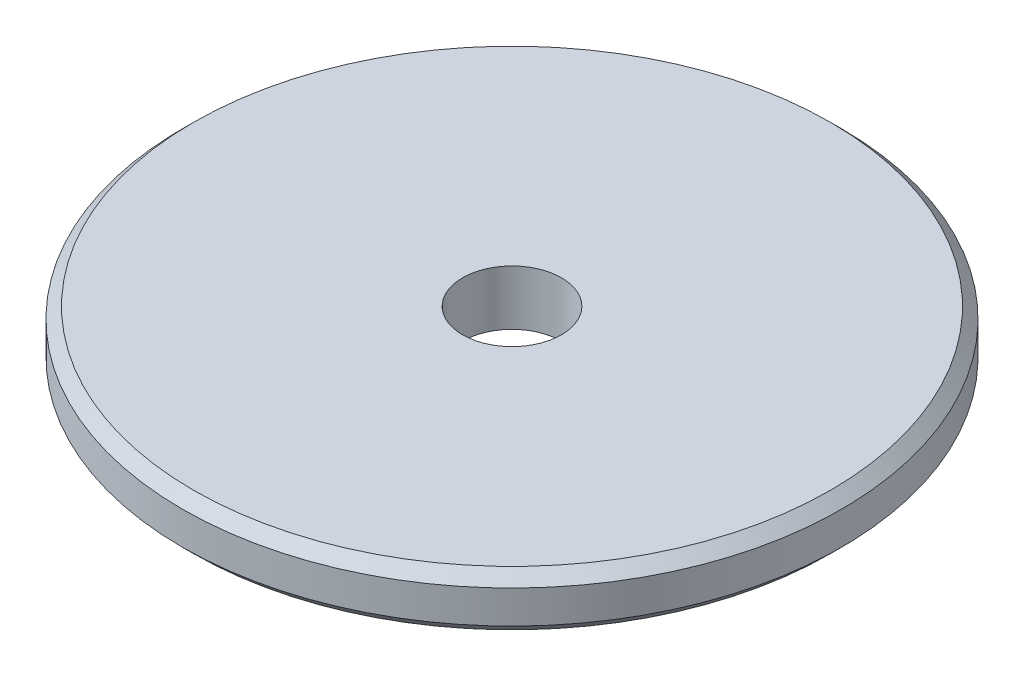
from build123d import *

# Parameters (mm, degrees)
SKETCH1_R      = 30
SKETCH1_R_2    = 4.5
EXTRUDE1_DEPTH = 5
CHAMFER1_SIZE  = 1


with BuildPart() as part:
    # Sketch1 → Extrude1 (new body)
    with BuildSketch(Plane(origin=(0, 0, 0), x_dir=(1, 0, 0), z_dir=(0, 1, 0))):
        with Locations(Location((0, 0, 0), (0, 0, 270))):
            Circle(SKETCH1_R)
        with Locations(Location((0, 0, 0), (0, 0, 270))):
            Circle(SKETCH1_R_2, mode=Mode.SUBTRACT)
    extrude(amount=EXTRUDE1_DEPTH)

    # Chamfer1
    chamfer1_edges = [part.edges().sort_by_distance(p)[0] for p in [
        (0, 0, -30),
        (0, 5, -30),
    ]]
    chamfer(chamfer1_edges, length=CHAMFER1_SIZE)


solid = part.part
